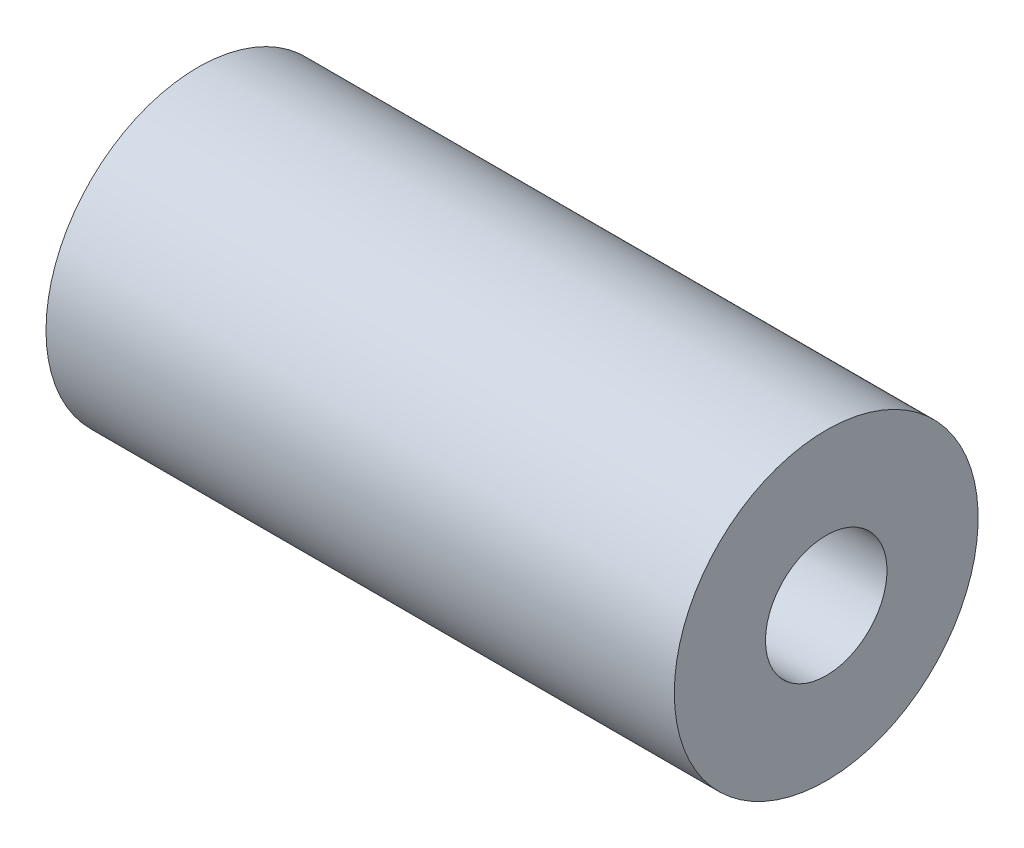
ISO-10303-21;
HEADER;
FILE_DESCRIPTION(('STEP AP214'),'2;1');
FILE_NAME('part.step','',(''),(''),'','','');
FILE_SCHEMA(('AUTOMOTIVE_DESIGN { 1 0 10303 214 1 1 1 1 }'));
ENDSEC;
DATA;
#1=APPLICATION_CONTEXT('core data for automotive mechanical design processes');
#2=APPLICATION_PROTOCOL_DEFINITION('international standard','automotive_design',2000,#1);
#3=PRODUCT_CONTEXT('',#1,'mechanical');
#4=PRODUCT('Part','Part','',(#3));
#5=PRODUCT_RELATED_PRODUCT_CATEGORY('part','',(#4));
#6=PRODUCT_DEFINITION_FORMATION('','',#4);
#7=PRODUCT_DEFINITION_CONTEXT('part definition',#1,'design');
#8=PRODUCT_DEFINITION('design','',#6,#7);
#9=PRODUCT_DEFINITION_SHAPE('','',#8);
#10=(LENGTH_UNIT() NAMED_UNIT(*) SI_UNIT(.MILLI.,.METRE.));
#11=(NAMED_UNIT(*) PLANE_ANGLE_UNIT() SI_UNIT($,.RADIAN.));
#12=(NAMED_UNIT(*) SI_UNIT($,.STERADIAN.) SOLID_ANGLE_UNIT());
#13=UNCERTAINTY_MEASURE_WITH_UNIT(LENGTH_MEASURE(1.E-05),#10,'distance_accuracy_value','');
#14=(GEOMETRIC_REPRESENTATION_CONTEXT(3) GLOBAL_UNCERTAINTY_ASSIGNED_CONTEXT((#13)) GLOBAL_UNIT_ASSIGNED_CONTEXT((#10,
#11,#12)) REPRESENTATION_CONTEXT('',''));
#15=CARTESIAN_POINT('',(0.,0.,0.));
#16=DIRECTION('',(0.,0.,1.));
#17=DIRECTION('',(1.,0.,0.));
#18=AXIS2_PLACEMENT_3D('',#15,#16,#17);
#19=CARTESIAN_POINT('',(-25.5720184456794,0.,0.));
#20=DIRECTION('',(-1.,0.,0.));
#21=DIRECTION('',(0.,0.,1.));
#22=AXIS2_PLACEMENT_3D('',#19,#20,#21);
#23=CYLINDRICAL_SURFACE('',#22,12.5);
#24=CARTESIAN_POINT('',(-18.3801768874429,0.,0.));
#25=DIRECTION('',(-1.,0.,0.));
#26=DIRECTION('',(0.,0.,1.));
#27=AXIS2_PLACEMENT_3D('',#24,#25,#26);
#28=CIRCLE('',#27,12.5);
#29=CARTESIAN_POINT('',(-18.3801768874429,0.,12.5));
#30=VERTEX_POINT('',#29);
#31=EDGE_CURVE('E54',#30,#30,#28,.T.);
#32=ORIENTED_EDGE('',*,*,#31,.F.);
#33=EDGE_LOOP('',(#32));
#34=FACE_BOUND('',#33,.T.);
#35=CARTESIAN_POINT('',(33.3198231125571,0.,0.));
#36=DIRECTION('',(-1.,0.,0.));
#37=DIRECTION('',(0.,0.,1.));
#38=AXIS2_PLACEMENT_3D('',#35,#36,#37);
#39=CIRCLE('',#38,12.5);
#40=CARTESIAN_POINT('',(33.3198231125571,0.,12.5));
#41=VERTEX_POINT('',#40);
#42=EDGE_CURVE('E10',#41,#41,#39,.T.);
#43=ORIENTED_EDGE('',*,*,#42,.T.);
#44=EDGE_LOOP('',(#43));
#45=FACE_BOUND('',#44,.T.);
#46=ADVANCED_FACE('F37',(#34,#45),#23,.T.);
#47=CARTESIAN_POINT('',(33.3198231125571,12.5,0.));
#48=DIRECTION('',(-1.,0.,0.));
#49=DIRECTION('',(0.,0.,1.));
#50=AXIS2_PLACEMENT_3D('',#47,#48,#49);
#51=PLANE('',#50);
#52=ORIENTED_EDGE('',*,*,#42,.F.);
#53=EDGE_LOOP('',(#52));
#54=FACE_BOUND('',#53,.T.);
#55=CARTESIAN_POINT('',(33.3198231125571,0.,0.));
#56=DIRECTION('',(-1.,0.,0.));
#57=DIRECTION('',(0.,0.,1.));
#58=AXIS2_PLACEMENT_3D('',#55,#56,#57);
#59=CIRCLE('',#58,5.);
#60=CARTESIAN_POINT('',(33.3198231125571,0.,5.));
#61=VERTEX_POINT('',#60);
#62=EDGE_CURVE('E44',#61,#61,#59,.T.);
#63=ORIENTED_EDGE('',*,*,#62,.T.);
#64=EDGE_LOOP('',(#63));
#65=FACE_BOUND('',#64,.T.);
#66=ADVANCED_FACE('F64',(#54,#65),#51,.F.);
#67=CARTESIAN_POINT('',(-25.5720184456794,0.,0.));
#68=DIRECTION('',(-1.,0.,0.));
#69=DIRECTION('',(0.,0.,1.));
#70=AXIS2_PLACEMENT_3D('',#67,#68,#69);
#71=CYLINDRICAL_SURFACE('',#70,5.);
#72=ORIENTED_EDGE('',*,*,#62,.F.);
#73=EDGE_LOOP('',(#72));
#74=FACE_BOUND('',#73,.T.);
#75=CARTESIAN_POINT('',(-18.3801768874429,0.,0.));
#76=DIRECTION('',(-1.,0.,0.));
#77=DIRECTION('',(0.,0.,1.));
#78=AXIS2_PLACEMENT_3D('',#75,#76,#77);
#79=CIRCLE('',#78,5.);
#80=CARTESIAN_POINT('',(-18.3801768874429,0.,5.));
#81=VERTEX_POINT('',#80);
#82=EDGE_CURVE('E49',#81,#81,#79,.T.);
#83=ORIENTED_EDGE('',*,*,#82,.T.);
#84=EDGE_LOOP('',(#83));
#85=FACE_BOUND('',#84,.T.);
#86=ADVANCED_FACE('F68',(#74,#85),#71,.F.);
#87=CARTESIAN_POINT('',(-18.3801768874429,5.,0.));
#88=DIRECTION('',(1.,0.,0.));
#89=DIRECTION('',(0.,0.,-1.));
#90=AXIS2_PLACEMENT_3D('',#87,#88,#89);
#91=PLANE('',#90);
#92=ORIENTED_EDGE('',*,*,#82,.F.);
#93=EDGE_LOOP('',(#92));
#94=FACE_BOUND('',#93,.T.);
#95=ORIENTED_EDGE('',*,*,#31,.T.);
#96=EDGE_LOOP('',(#95));
#97=FACE_BOUND('',#96,.T.);
#98=ADVANCED_FACE('F61',(#94,#97),#91,.F.);
#99=CLOSED_SHELL('',(#46,#66,#86,#98));
#100=MANIFOLD_SOLID_BREP('B2',#99);
#101=ADVANCED_BREP_SHAPE_REPRESENTATION('',(#18,#100),#14);
#102=SHAPE_DEFINITION_REPRESENTATION(#9,#101);
ENDSEC;
END-ISO-10303-21;
